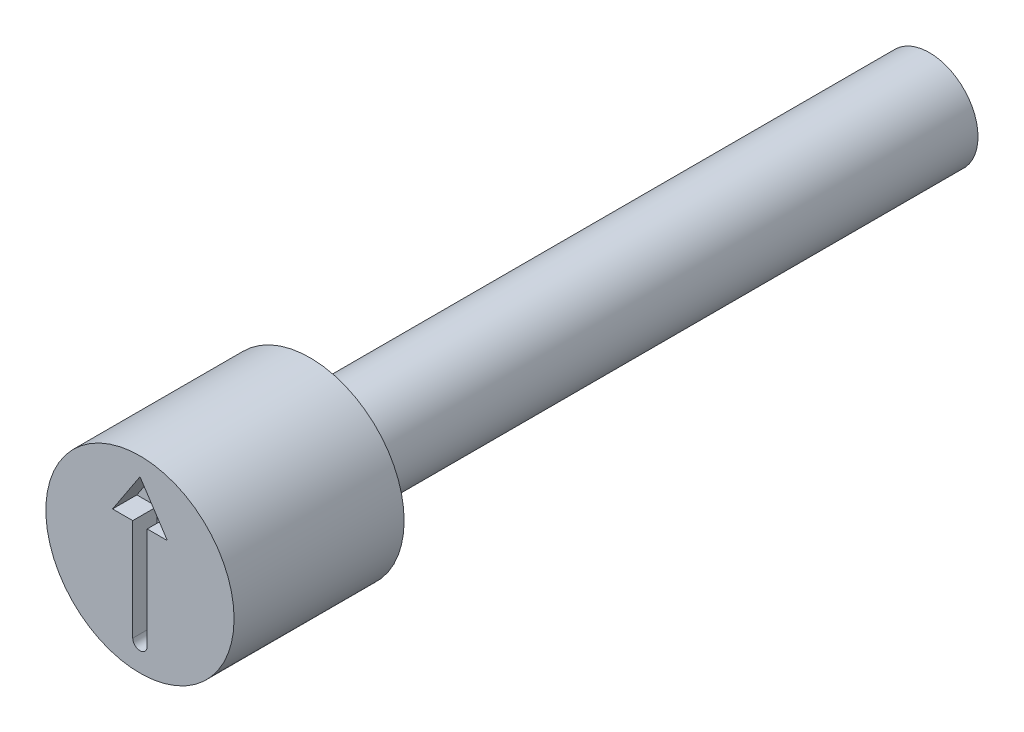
ISO-10303-21;
HEADER;
FILE_DESCRIPTION(('STEP AP214'),'2;1');
FILE_NAME('part.step','',(''),(''),'','','');
FILE_SCHEMA(('AUTOMOTIVE_DESIGN { 1 0 10303 214 1 1 1 1 }'));
ENDSEC;
DATA;
#1=APPLICATION_CONTEXT('core data for automotive mechanical design processes');
#2=APPLICATION_PROTOCOL_DEFINITION('international standard','automotive_design',2000,#1);
#3=PRODUCT_CONTEXT('',#1,'mechanical');
#4=PRODUCT('Part','Part','',(#3));
#5=PRODUCT_RELATED_PRODUCT_CATEGORY('part','',(#4));
#6=PRODUCT_DEFINITION_FORMATION('','',#4);
#7=PRODUCT_DEFINITION_CONTEXT('part definition',#1,'design');
#8=PRODUCT_DEFINITION('design','',#6,#7);
#9=PRODUCT_DEFINITION_SHAPE('','',#8);
#10=(LENGTH_UNIT() NAMED_UNIT(*) SI_UNIT(.MILLI.,.METRE.));
#11=(NAMED_UNIT(*) PLANE_ANGLE_UNIT() SI_UNIT($,.RADIAN.));
#12=(NAMED_UNIT(*) SI_UNIT($,.STERADIAN.) SOLID_ANGLE_UNIT());
#13=UNCERTAINTY_MEASURE_WITH_UNIT(LENGTH_MEASURE(1.E-05),#10,'distance_accuracy_value','');
#14=(GEOMETRIC_REPRESENTATION_CONTEXT(3) GLOBAL_UNCERTAINTY_ASSIGNED_CONTEXT((#13)) GLOBAL_UNIT_ASSIGNED_CONTEXT((#10,
#11,#12)) REPRESENTATION_CONTEXT('',''));
#15=CARTESIAN_POINT('',(0.,0.,0.));
#16=DIRECTION('',(0.,0.,1.));
#17=DIRECTION('',(1.,0.,0.));
#18=AXIS2_PLACEMENT_3D('',#15,#16,#17);
#19=CARTESIAN_POINT('',(0.,0.799999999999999,-2.8));
#20=DIRECTION('',(0.,0.,1.));
#21=DIRECTION('',(1.,0.,0.));
#22=AXIS2_PLACEMENT_3D('',#19,#20,#21);
#23=PLANE('',#22);
#24=CARTESIAN_POINT('',(0.,0.,-2.8));
#25=DIRECTION('',(0.,0.,1.));
#26=DIRECTION('',(1.,0.,0.));
#27=AXIS2_PLACEMENT_3D('',#24,#25,#26);
#28=CIRCLE('',#27,1.55);
#29=CARTESIAN_POINT('',(1.55,0.,-2.8));
#30=VERTEX_POINT('',#29);
#31=EDGE_CURVE('E11',#30,#30,#28,.T.);
#32=ORIENTED_EDGE('',*,*,#31,.F.);
#33=EDGE_LOOP('',(#32));
#34=FACE_BOUND('',#33,.T.);
#35=CARTESIAN_POINT('',(0.,0.,-2.8));
#36=DIRECTION('',(0.,0.,1.));
#37=DIRECTION('',(1.,0.,0.));
#38=AXIS2_PLACEMENT_3D('',#35,#36,#37);
#39=CIRCLE('',#38,0.799999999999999);
#40=CARTESIAN_POINT('',(0.799999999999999,0.,-2.8));
#41=VERTEX_POINT('',#40);
#42=EDGE_CURVE('E144',#41,#41,#39,.T.);
#43=ORIENTED_EDGE('',*,*,#42,.T.);
#44=EDGE_LOOP('',(#43));
#45=FACE_BOUND('',#44,.T.);
#46=ADVANCED_FACE('F34',(#34,#45),#23,.F.);
#47=CARTESIAN_POINT('',(0.,0.,-0.403888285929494));
#48=DIRECTION('',(0.,0.,1.));
#49=DIRECTION('',(1.,0.,0.));
#50=AXIS2_PLACEMENT_3D('',#47,#48,#49);
#51=CYLINDRICAL_SURFACE('',#50,1.55);
#52=CARTESIAN_POINT('',(0.,0.,0.));
#53=DIRECTION('',(0.,0.,1.));
#54=DIRECTION('',(1.,0.,0.));
#55=AXIS2_PLACEMENT_3D('',#52,#53,#54);
#56=CIRCLE('',#55,1.55);
#57=CARTESIAN_POINT('',(1.55,0.,0.));
#58=VERTEX_POINT('',#57);
#59=EDGE_CURVE('E41',#58,#58,#56,.T.);
#60=ORIENTED_EDGE('',*,*,#59,.F.);
#61=EDGE_LOOP('',(#60));
#62=FACE_BOUND('',#61,.T.);
#63=ORIENTED_EDGE('',*,*,#31,.T.);
#64=EDGE_LOOP('',(#63));
#65=FACE_BOUND('',#64,.T.);
#66=ADVANCED_FACE('F161',(#62,#65),#51,.T.);
#67=CARTESIAN_POINT('',(0.,1.55,0.));
#68=DIRECTION('',(0.,0.,-1.));
#69=DIRECTION('',(-1.,0.,0.));
#70=AXIS2_PLACEMENT_3D('',#67,#68,#69);
#71=PLANE('',#70);
#72=DIRECTION('',(0.,1.,0.));
#73=VECTOR('',#72,1.);
#74=CARTESIAN_POINT('',(0.119045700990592,0.566469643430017,0.));
#75=LINE('',#74,#73);
#76=CARTESIAN_POINT('',(0.119045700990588,-1.11010114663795,0.));
#77=VERTEX_POINT('',#76);
#78=CARTESIAN_POINT('',(0.119045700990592,0.566469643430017,0.));
#79=VERTEX_POINT('',#78);
#80=EDGE_CURVE('E128',#77,#79,#75,.T.);
#81=ORIENTED_EDGE('',*,*,#80,.F.);
#82=CARTESIAN_POINT('',(1.02140308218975E-13,-1.11010114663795,0.));
#83=DIRECTION('',(0.,0.,1.));
#84=DIRECTION('',(1.,0.,0.));
#85=AXIS2_PLACEMENT_3D('',#82,#83,#84);
#86=CIRCLE('',#85,0.119045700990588);
#87=CARTESIAN_POINT('',(-0.119045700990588,-1.11010114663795,0.));
#88=VERTEX_POINT('',#87);
#89=EDGE_CURVE('E48',#88,#77,#86,.T.);
#90=ORIENTED_EDGE('',*,*,#89,.F.);
#91=DIRECTION('',(0.,-1.,0.));
#92=VECTOR('',#91,1.);
#93=CARTESIAN_POINT('',(-0.119045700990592,0.566469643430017,0.));
#94=LINE('',#93,#92);
#95=CARTESIAN_POINT('',(-0.119045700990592,0.566469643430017,0.));
#96=VERTEX_POINT('',#95);
#97=EDGE_CURVE('E140',#96,#88,#94,.T.);
#98=ORIENTED_EDGE('',*,*,#97,.F.);
#99=DIRECTION('',(1.,0.,0.));
#100=VECTOR('',#99,1.);
#101=CARTESIAN_POINT('',(-0.451198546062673,0.566469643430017,0.));
#102=LINE('',#101,#100);
#103=CARTESIAN_POINT('',(-0.451198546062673,0.566469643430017,0.));
#104=VERTEX_POINT('',#103);
#105=EDGE_CURVE('E138',#104,#96,#102,.T.);
#106=ORIENTED_EDGE('',*,*,#105,.F.);
#107=DIRECTION('',(-0.550159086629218,-0.835059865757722,0.));
#108=VECTOR('',#107,1.);
#109=CARTESIAN_POINT('',(0.,1.25132209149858,0.));
#110=LINE('',#109,#108);
#111=CARTESIAN_POINT('',(0.,1.25132209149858,0.));
#112=VERTEX_POINT('',#111);
#113=EDGE_CURVE('E102',#112,#104,#110,.T.);
#114=ORIENTED_EDGE('',*,*,#113,.F.);
#115=DIRECTION('',(-0.550159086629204,0.835059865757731,0.));
#116=VECTOR('',#115,1.);
#117=CARTESIAN_POINT('',(0.,1.25132209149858,0.));
#118=LINE('',#117,#116);
#119=CARTESIAN_POINT('',(0.451198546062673,0.566469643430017,0.));
#120=VERTEX_POINT('',#119);
#121=EDGE_CURVE('E134',#120,#112,#118,.T.);
#122=ORIENTED_EDGE('',*,*,#121,.F.);
#123=DIRECTION('',(1.,0.,0.));
#124=VECTOR('',#123,1.);
#125=CARTESIAN_POINT('',(0.451198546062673,0.566469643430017,0.));
#126=LINE('',#125,#124);
#127=EDGE_CURVE('E131',#79,#120,#126,.T.);
#128=ORIENTED_EDGE('',*,*,#127,.F.);
#129=EDGE_LOOP('',(#81,#90,#98,#106,#114,#122,#128));
#130=FACE_BOUND('',#129,.T.);
#131=ORIENTED_EDGE('',*,*,#59,.T.);
#132=EDGE_LOOP('',(#131));
#133=FACE_BOUND('',#132,.T.);
#134=ADVANCED_FACE('F159',(#130,#133),#71,.F.);
#135=CARTESIAN_POINT('',(0.,0.,-13.));
#136=DIRECTION('',(0.,0.,1.));
#137=DIRECTION('',(1.,0.,0.));
#138=AXIS2_PLACEMENT_3D('',#135,#136,#137);
#139=PLANE('',#138);
#140=CARTESIAN_POINT('',(0.,0.,-13.));
#141=DIRECTION('',(0.,0.,1.));
#142=DIRECTION('',(1.,0.,0.));
#143=AXIS2_PLACEMENT_3D('',#140,#141,#142);
#144=CIRCLE('',#143,0.8);
#145=CARTESIAN_POINT('',(0.8,0.,-13.));
#146=VERTEX_POINT('',#145);
#147=EDGE_CURVE('E154',#146,#146,#144,.T.);
#148=ORIENTED_EDGE('',*,*,#147,.F.);
#149=EDGE_LOOP('',(#148));
#150=FACE_BOUND('',#149,.T.);
#151=ADVANCED_FACE('F174',(#150),#139,.F.);
#152=CARTESIAN_POINT('',(0.,0.,-0.403888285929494));
#153=DIRECTION('',(0.,0.,1.));
#154=DIRECTION('',(1.,0.,0.));
#155=AXIS2_PLACEMENT_3D('',#152,#153,#154);
#156=CYLINDRICAL_SURFACE('',#155,0.8);
#157=ORIENTED_EDGE('',*,*,#42,.F.);
#158=EDGE_LOOP('',(#157));
#159=FACE_BOUND('',#158,.T.);
#160=ORIENTED_EDGE('',*,*,#147,.T.);
#161=EDGE_LOOP('',(#160));
#162=FACE_BOUND('',#161,.T.);
#163=ADVANCED_FACE('F170',(#159,#162),#156,.T.);
#164=CARTESIAN_POINT('',(1.02140308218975E-13,-1.11010114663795,-0.4));
#165=DIRECTION('',(0.,0.,1.));
#166=DIRECTION('',(1.,0.,0.));
#167=AXIS2_PLACEMENT_3D('',#164,#165,#166);
#168=CYLINDRICAL_SURFACE('',#167,0.119045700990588);
#169=ORIENTED_EDGE('',*,*,#89,.T.);
#170=DIRECTION('',(0.,0.,1.));
#171=VECTOR('',#170,1.);
#172=CARTESIAN_POINT('',(0.119045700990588,-1.11010114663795,-0.4));
#173=LINE('',#172,#171);
#174=CARTESIAN_POINT('',(0.119045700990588,-1.11010114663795,-0.4));
#175=VERTEX_POINT('',#174);
#176=EDGE_CURVE('E81',#175,#77,#173,.T.);
#177=ORIENTED_EDGE('',*,*,#176,.F.);
#178=CARTESIAN_POINT('',(1.02140308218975E-13,-1.11010114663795,-0.4));
#179=DIRECTION('',(0.,0.,1.));
#180=DIRECTION('',(1.,0.,0.));
#181=AXIS2_PLACEMENT_3D('',#178,#179,#180);
#182=CIRCLE('',#181,0.119045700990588);
#183=CARTESIAN_POINT('',(-0.119045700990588,-1.11010114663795,-0.4));
#184=VERTEX_POINT('',#183);
#185=EDGE_CURVE('E142',#184,#175,#182,.T.);
#186=ORIENTED_EDGE('',*,*,#185,.F.);
#187=DIRECTION('',(0.,0.,1.));
#188=VECTOR('',#187,1.);
#189=CARTESIAN_POINT('',(-0.119045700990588,-1.11010114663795,-0.4));
#190=LINE('',#189,#188);
#191=EDGE_CURVE('E56',#184,#88,#190,.T.);
#192=ORIENTED_EDGE('',*,*,#191,.T.);
#193=EDGE_LOOP('',(#169,#177,#186,#192));
#194=FACE_BOUND('',#193,.T.);
#195=ADVANCED_FACE('F173',(#194),#168,.F.);
#196=CARTESIAN_POINT('',(-0.119045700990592,0.566469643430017,-0.4));
#197=DIRECTION('',(-1.,0.,0.));
#198=DIRECTION('',(0.,-1.,0.));
#199=AXIS2_PLACEMENT_3D('',#196,#197,#198);
#200=PLANE('',#199);
#201=ORIENTED_EDGE('',*,*,#97,.T.);
#202=ORIENTED_EDGE('',*,*,#191,.F.);
#203=DIRECTION('',(0.,-1.,0.));
#204=VECTOR('',#203,1.);
#205=CARTESIAN_POINT('',(-0.119045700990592,0.566469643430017,-0.4));
#206=LINE('',#205,#204);
#207=CARTESIAN_POINT('',(-0.119045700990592,0.566469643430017,-0.4));
#208=VERTEX_POINT('',#207);
#209=EDGE_CURVE('E114',#208,#184,#206,.T.);
#210=ORIENTED_EDGE('',*,*,#209,.F.);
#211=DIRECTION('',(0.,0.,1.));
#212=VECTOR('',#211,1.);
#213=CARTESIAN_POINT('',(-0.119045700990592,0.566469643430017,-0.4));
#214=LINE('',#213,#212);
#215=EDGE_CURVE('E106',#208,#96,#214,.T.);
#216=ORIENTED_EDGE('',*,*,#215,.T.);
#217=EDGE_LOOP('',(#201,#202,#210,#216));
#218=FACE_BOUND('',#217,.T.);
#219=ADVANCED_FACE('F188',(#218),#200,.F.);
#220=CARTESIAN_POINT('',(-0.451198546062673,0.566469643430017,-0.4));
#221=DIRECTION('',(0.,-1.,0.));
#222=DIRECTION('',(0.,0.,-1.));
#223=AXIS2_PLACEMENT_3D('',#220,#221,#222);
#224=PLANE('',#223);
#225=ORIENTED_EDGE('',*,*,#105,.T.);
#226=ORIENTED_EDGE('',*,*,#215,.F.);
#227=DIRECTION('',(1.,0.,0.));
#228=VECTOR('',#227,1.);
#229=CARTESIAN_POINT('',(-0.451198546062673,0.566469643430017,-0.4));
#230=LINE('',#229,#228);
#231=CARTESIAN_POINT('',(-0.451198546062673,0.566469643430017,-0.4));
#232=VERTEX_POINT('',#231);
#233=EDGE_CURVE('E110',#232,#208,#230,.T.);
#234=ORIENTED_EDGE('',*,*,#233,.F.);
#235=DIRECTION('',(0.,0.,1.));
#236=VECTOR('',#235,1.);
#237=CARTESIAN_POINT('',(-0.451198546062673,0.566469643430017,-0.4));
#238=LINE('',#237,#236);
#239=EDGE_CURVE('E95',#232,#104,#238,.T.);
#240=ORIENTED_EDGE('',*,*,#239,.T.);
#241=EDGE_LOOP('',(#225,#226,#234,#240));
#242=FACE_BOUND('',#241,.T.);
#243=ADVANCED_FACE('F111',(#242),#224,.F.);
#244=CARTESIAN_POINT('',(0.,1.25132209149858,-0.4));
#245=DIRECTION('',(-0.835059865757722,0.550159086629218,0.));
#246=DIRECTION('',(-0.550159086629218,-0.835059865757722,0.));
#247=AXIS2_PLACEMENT_3D('',#244,#245,#246);
#248=PLANE('',#247);
#249=ORIENTED_EDGE('',*,*,#113,.T.);
#250=ORIENTED_EDGE('',*,*,#239,.F.);
#251=DIRECTION('',(-0.550159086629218,-0.835059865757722,0.));
#252=VECTOR('',#251,1.);
#253=CARTESIAN_POINT('',(0.,1.25132209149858,-0.4));
#254=LINE('',#253,#252);
#255=CARTESIAN_POINT('',(0.,1.25132209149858,-0.4));
#256=VERTEX_POINT('',#255);
#257=EDGE_CURVE('E99',#256,#232,#254,.T.);
#258=ORIENTED_EDGE('',*,*,#257,.F.);
#259=DIRECTION('',(0.,0.,1.));
#260=VECTOR('',#259,1.);
#261=CARTESIAN_POINT('',(0.,1.25132209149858,-0.4));
#262=LINE('',#261,#260);
#263=EDGE_CURVE('E107',#256,#112,#262,.T.);
#264=ORIENTED_EDGE('',*,*,#263,.T.);
#265=EDGE_LOOP('',(#249,#250,#258,#264));
#266=FACE_BOUND('',#265,.T.);
#267=ADVANCED_FACE('F97',(#266),#248,.F.);
#268=CARTESIAN_POINT('',(0.,1.25132209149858,-0.4));
#269=DIRECTION('',(0.835059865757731,0.550159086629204,0.));
#270=DIRECTION('',(-0.550159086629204,0.835059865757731,0.));
#271=AXIS2_PLACEMENT_3D('',#268,#269,#270);
#272=PLANE('',#271);
#273=ORIENTED_EDGE('',*,*,#121,.T.);
#274=ORIENTED_EDGE('',*,*,#263,.F.);
#275=DIRECTION('',(-0.550159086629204,0.835059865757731,0.));
#276=VECTOR('',#275,1.);
#277=CARTESIAN_POINT('',(0.,1.25132209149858,-0.4));
#278=LINE('',#277,#276);
#279=CARTESIAN_POINT('',(0.451198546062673,0.566469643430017,-0.4));
#280=VERTEX_POINT('',#279);
#281=EDGE_CURVE('E120',#280,#256,#278,.T.);
#282=ORIENTED_EDGE('',*,*,#281,.F.);
#283=DIRECTION('',(0.,0.,1.));
#284=VECTOR('',#283,1.);
#285=CARTESIAN_POINT('',(0.451198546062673,0.566469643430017,-0.4));
#286=LINE('',#285,#284);
#287=EDGE_CURVE('E147',#280,#120,#286,.T.);
#288=ORIENTED_EDGE('',*,*,#287,.T.);
#289=EDGE_LOOP('',(#273,#274,#282,#288));
#290=FACE_BOUND('',#289,.T.);
#291=ADVANCED_FACE('F196',(#290),#272,.F.);
#292=CARTESIAN_POINT('',(0.451198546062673,0.566469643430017,-0.4));
#293=DIRECTION('',(0.,-1.,0.));
#294=DIRECTION('',(0.,0.,-1.));
#295=AXIS2_PLACEMENT_3D('',#292,#293,#294);
#296=PLANE('',#295);
#297=ORIENTED_EDGE('',*,*,#127,.T.);
#298=ORIENTED_EDGE('',*,*,#287,.F.);
#299=DIRECTION('',(1.,0.,0.));
#300=VECTOR('',#299,1.);
#301=CARTESIAN_POINT('',(0.451198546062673,0.566469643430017,-0.4));
#302=LINE('',#301,#300);
#303=CARTESIAN_POINT('',(0.119045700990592,0.566469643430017,-0.4));
#304=VERTEX_POINT('',#303);
#305=EDGE_CURVE('E122',#304,#280,#302,.T.);
#306=ORIENTED_EDGE('',*,*,#305,.F.);
#307=DIRECTION('',(0.,0.,1.));
#308=VECTOR('',#307,1.);
#309=CARTESIAN_POINT('',(0.119045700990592,0.566469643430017,-0.4));
#310=LINE('',#309,#308);
#311=EDGE_CURVE('E149',#304,#79,#310,.T.);
#312=ORIENTED_EDGE('',*,*,#311,.T.);
#313=EDGE_LOOP('',(#297,#298,#306,#312));
#314=FACE_BOUND('',#313,.T.);
#315=ADVANCED_FACE('F192',(#314),#296,.F.);
#316=CARTESIAN_POINT('',(0.119045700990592,0.566469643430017,-0.4));
#317=DIRECTION('',(1.,0.,0.));
#318=DIRECTION('',(0.,1.,0.));
#319=AXIS2_PLACEMENT_3D('',#316,#317,#318);
#320=PLANE('',#319);
#321=ORIENTED_EDGE('',*,*,#80,.T.);
#322=ORIENTED_EDGE('',*,*,#311,.F.);
#323=DIRECTION('',(0.,1.,0.));
#324=VECTOR('',#323,1.);
#325=CARTESIAN_POINT('',(0.119045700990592,0.566469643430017,-0.4));
#326=LINE('',#325,#324);
#327=EDGE_CURVE('E290',#175,#304,#326,.T.);
#328=ORIENTED_EDGE('',*,*,#327,.F.);
#329=ORIENTED_EDGE('',*,*,#176,.T.);
#330=EDGE_LOOP('',(#321,#322,#328,#329));
#331=FACE_BOUND('',#330,.T.);
#332=ADVANCED_FACE('F189',(#331),#320,.F.);
#333=CARTESIAN_POINT('',(1.02140308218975E-13,-1.11010114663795,-0.4));
#334=DIRECTION('',(0.,0.,1.));
#335=DIRECTION('',(1.,0.,0.));
#336=AXIS2_PLACEMENT_3D('',#333,#334,#335);
#337=PLANE('',#336);
#338=ORIENTED_EDGE('',*,*,#185,.T.);
#339=ORIENTED_EDGE('',*,*,#327,.T.);
#340=ORIENTED_EDGE('',*,*,#305,.T.);
#341=ORIENTED_EDGE('',*,*,#281,.T.);
#342=ORIENTED_EDGE('',*,*,#257,.T.);
#343=ORIENTED_EDGE('',*,*,#233,.T.);
#344=ORIENTED_EDGE('',*,*,#209,.T.);
#345=EDGE_LOOP('',(#338,#339,#340,#341,#342,#343,#344));
#346=FACE_BOUND('',#345,.T.);
#347=ADVANCED_FACE('F117',(#346),#337,.T.);
#348=CLOSED_SHELL('',(#46,#66,#134,#151,#163,#195,#219,#243,#267,#291,#315,#332,#347));
#349=MANIFOLD_SOLID_BREP('B2',#348);
#350=ADVANCED_BREP_SHAPE_REPRESENTATION('',(#18,#349),#14);
#351=SHAPE_DEFINITION_REPRESENTATION(#9,#350);
ENDSEC;
END-ISO-10303-21;
